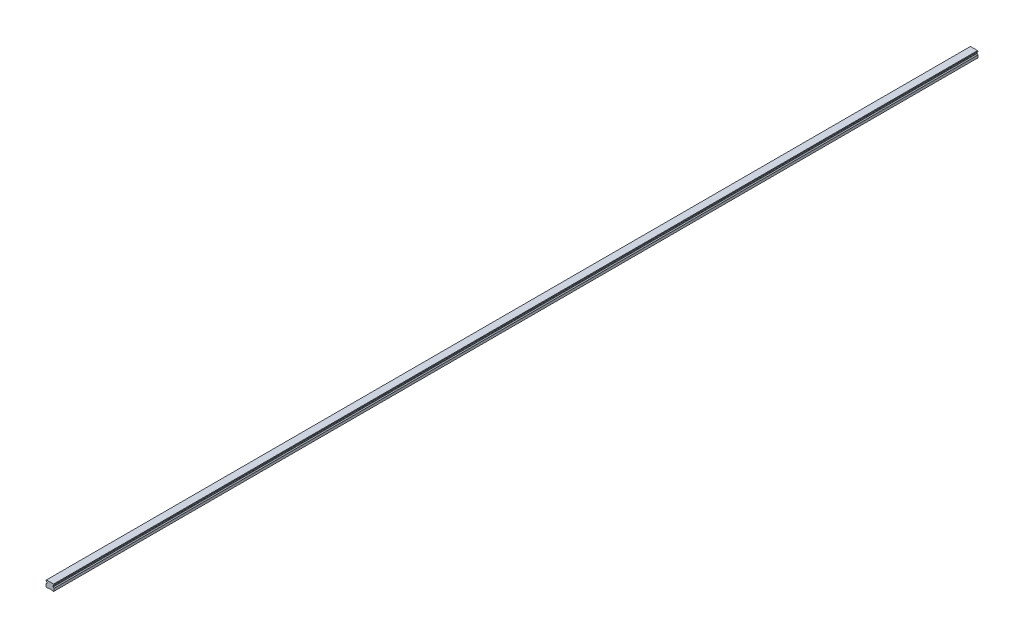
from build123d import *

# Parameters (mm, degrees)
SKETCH1_W           = 20
SKETCH1_H           = 16.3
BOSS_EXTRUDE1_DEPTH = 1160
CUT_EXTRUDE1_DEPTH  = 2321.078811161
CHAMFER1_SIZE       = 1
FILLET1_R           = 1
CUT_EXTRUDE2_DEPTH  = 2321.078811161
SKETCH5_R           = 3
SKETCH5_R_2         = 2.5
CUT_EXTRUDE5_DEPTH  = 10
SKETCH5_2_R         = 2.5
CUT_EXTRUDE6_DEPTH  = 13
LPATTERN2_COUNT     = 39
LPATTERN2_PITCH     = 60


with BuildPart() as part:
    # Sketch1 → Boss-Extrude1 (new, symmetric)
    with BuildSketch(Plane.XY):
        with Locations((0, 8.15)):
            Rectangle(SKETCH1_W, SKETCH1_H)
    extrude(amount=BOSS_EXTRUDE1_DEPTH, both=True)

    # Sketch2 → Cut-Extrude1 (cut, through all)
    with BuildSketch(Plane.XY.offset(1160)):
        Polygon((-10, 14.3), (-10, 7.3), (-7.666666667, 9.633333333), (-7.666666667, 11.966666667), align=None)
        Polygon((7.666666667, 11.966666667), (10, 14.3), (10, 7.3), (7.666666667, 9.633333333), align=None)
    extrude(amount=-CUT_EXTRUDE1_DEPTH, mode=Mode.SUBTRACT)

    # Chamfer1
    chamfer1_edges = [part.edges().sort_by_distance(p)[0] for p in [
        (-10, 16.3, 0),
        (10, 16.3, 0),
        (10, 0, 0),
        (-10, 0, 0),
    ]]
    chamfer(chamfer1_edges, length=CHAMFER1_SIZE)

    # Fillet1
    fillet1_edges = [part.edges().sort_by_distance(p)[0] for p in [
        (-7.666666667, 11.966666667, 0),
        (-7.666666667, 9.633333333, 0),
        (7.666666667, 9.633333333, 0),
        (7.666666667, 11.966666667, 0),
    ]]
    fillet(fillet1_edges, radius=FILLET1_R)

    # Sketch3 → Cut-Extrude2 (cut, through all)
    with BuildSketch(Plane.XY.offset(1160)):
        Polygon((-6, 0), (-5, 1), (5, 1), (6, 0), align=None)
    extrude(amount=-CUT_EXTRUDE2_DEPTH, mode=Mode.SUBTRACT)

    # Sketch5 → Cut-Extrude5 (cut)
    with BuildSketch(Plane.XZ.offset(-1)):
        with Locations(Location((0, 1140, 0), (0, 0, 270))):
            Circle(SKETCH5_R)
        with Locations(Location((0, 1140, 0), (0, 0, 270))):
            Circle(SKETCH5_R_2, mode=Mode.SUBTRACT)
    cut_extrude5 = extrude(amount=-CUT_EXTRUDE5_DEPTH, mode=Mode.SUBTRACT)

    # Sketch5_2 → Cut-Extrude6 (cut)
    with BuildSketch(Plane.XZ.offset(-1)):
        with Locations(Location((0, 1140, 0), (0, 0, 270))):
            Circle(SKETCH5_2_R)
    cut_extrude6 = extrude(amount=-CUT_EXTRUDE6_DEPTH, mode=Mode.SUBTRACT)

    # Cut-Extrude7 cone 1 section (on through the dimple's axis) → Cut-Extrude7 (revolve, cut)
    with BuildSketch(Plane(origin=(0, 14, 1140), x_dir=(0, 0, -1), z_dir=(1, 0, 0))):
        Polygon((0, 0), (2.5, 0), (0, 1.443375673), align=None)
    cut_extrude7 = revolve(axis=Axis((0, 14, 1140), (0, 1, 0)), mode=Mode.SUBTRACT)

    # LPattern2: Cut-Extrude5, Cut-Extrude6, Cut-Extrude7 ×39
    with Locations(*[(0, 0, -i * LPATTERN2_PITCH) for i in range(1, LPATTERN2_COUNT)]):
        add(cut_extrude5, mode=Mode.SUBTRACT)
        add(cut_extrude6, mode=Mode.SUBTRACT)
        add(cut_extrude7, mode=Mode.SUBTRACT)


solid = part.part
